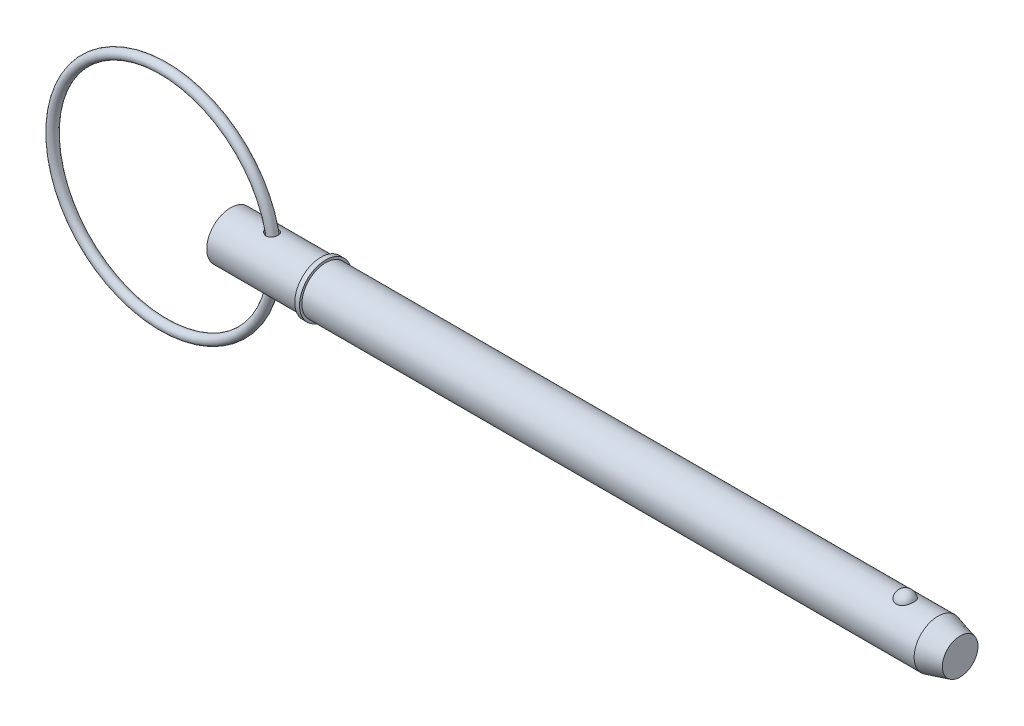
ISO-10303-21;
HEADER;
FILE_DESCRIPTION(('STEP AP214'),'2;1');
FILE_NAME('part.step','',(''),(''),'','','');
FILE_SCHEMA(('AUTOMOTIVE_DESIGN { 1 0 10303 214 1 1 1 1 }'));
ENDSEC;
DATA;
#1=APPLICATION_CONTEXT('core data for automotive mechanical design processes');
#2=APPLICATION_PROTOCOL_DEFINITION('international standard','automotive_design',2000,#1);
#3=PRODUCT_CONTEXT('',#1,'mechanical');
#4=PRODUCT('Part','Part','',(#3));
#5=PRODUCT_RELATED_PRODUCT_CATEGORY('part','',(#4));
#6=PRODUCT_DEFINITION_FORMATION('','',#4);
#7=PRODUCT_DEFINITION_CONTEXT('part definition',#1,'design');
#8=PRODUCT_DEFINITION('design','',#6,#7);
#9=PRODUCT_DEFINITION_SHAPE('','',#8);
#10=(LENGTH_UNIT() NAMED_UNIT(*) SI_UNIT(.MILLI.,.METRE.));
#11=(NAMED_UNIT(*) PLANE_ANGLE_UNIT() SI_UNIT($,.RADIAN.));
#12=(NAMED_UNIT(*) SI_UNIT($,.STERADIAN.) SOLID_ANGLE_UNIT());
#13=UNCERTAINTY_MEASURE_WITH_UNIT(LENGTH_MEASURE(1.E-05),#10,'distance_accuracy_value','');
#14=(GEOMETRIC_REPRESENTATION_CONTEXT(3) GLOBAL_UNCERTAINTY_ASSIGNED_CONTEXT((#13)) GLOBAL_UNIT_ASSIGNED_CONTEXT((#10,
#11,#12)) REPRESENTATION_CONTEXT('',''));
#15=CARTESIAN_POINT('',(0.,0.,0.));
#16=DIRECTION('',(0.,0.,1.));
#17=DIRECTION('',(1.,0.,0.));
#18=AXIS2_PLACEMENT_3D('',#15,#16,#17);
#19=CARTESIAN_POINT('',(-13.4013067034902,0.,0.));
#20=DIRECTION('',(0.,0.,1.));
#21=DIRECTION('',(1.,0.,0.));
#22=AXIS2_PLACEMENT_3D('',#19,#20,#21);
#23=TOROIDAL_SURFACE('',#22,22.225,0.952999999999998);
#24=CARTESIAN_POINT('',(9.77669329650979,0.,0.));
#25=VERTEX_POINT('',#24);
#26=VERTEX_LOOP('',#25);
#27=FACE_BOUND('',#26,.T.);
#28=ADVANCED_FACE('P0_F12',(#27),#23,.T.);
#29=CLOSED_SHELL('',(#28));
#30=MANIFOLD_SOLID_BREP('P0_B1',#29);
#31=CARTESIAN_POINT('',(0.,0.,0.));
#32=DIRECTION('',(1.,0.,0.));
#33=DIRECTION('',(0.,0.,-1.));
#34=AXIS2_PLACEMENT_3D('',#31,#32,#33);
#35=CYLINDRICAL_SURFACE('',#34,4.765);
#36=CARTESIAN_POINT('',(7.48459594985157,4.685973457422,-0.864220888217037));
#37=CARTESIAN_POINT('',(7.53849733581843,4.67711144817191,-0.912273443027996));
#38=CARTESIAN_POINT('',(7.59654891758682,4.66833039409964,-0.955745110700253));
#39=CARTESIAN_POINT('',(7.71924602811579,4.65195567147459,-1.03251233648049));
#40=CARTESIAN_POINT('',(7.78389917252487,4.64436340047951,-1.06579596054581));
#41=CARTESIAN_POINT('',(7.91808098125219,4.63129108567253,-1.12124172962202));
#42=CARTESIAN_POINT('',(7.98761280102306,4.62581242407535,-1.14339659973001));
#43=CARTESIAN_POINT('',(8.12956198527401,4.61771699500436,-1.17566870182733));
#44=CARTESIAN_POINT('',(8.20197774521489,4.61509865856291,-1.18579253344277));
#45=CARTESIAN_POINT('',(8.34550810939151,4.6131791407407,-1.19323853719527));
#46=CARTESIAN_POINT('',(8.41660306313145,4.61378793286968,-1.19090812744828));
#47=CARTESIAN_POINT('',(8.55721866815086,4.61812874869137,-1.17396277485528));
#48=CARTESIAN_POINT('',(8.62673979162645,4.62185982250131,-1.15935156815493));
#49=CARTESIAN_POINT('',(8.75801373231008,4.63172632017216,-1.11925454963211));
#50=CARTESIAN_POINT('',(8.81998342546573,4.63771186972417,-1.09443918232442));
#51=CARTESIAN_POINT('',(8.93863698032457,4.65140179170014,-1.03470792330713));
#52=CARTESIAN_POINT('',(8.99532131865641,4.65910600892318,-0.999792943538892));
#53=CARTESIAN_POINT('',(9.10080884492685,4.67519705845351,-0.921583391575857));
#54=CARTESIAN_POINT('',(9.14973848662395,4.68356861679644,-0.878455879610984));
#55=CARTESIAN_POINT('',(9.23971126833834,4.70019813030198,-0.784620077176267));
#56=CARTESIAN_POINT('',(9.28075401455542,4.7084560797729,-0.733911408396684));
#57=CARTESIAN_POINT('',(9.35441071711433,4.7240688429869,-0.62563775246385));
#58=CARTESIAN_POINT('',(9.38691359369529,4.73141115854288,-0.567995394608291));
#59=CARTESIAN_POINT('',(9.44203216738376,4.74427907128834,-0.447974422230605));
#60=CARTESIAN_POINT('',(9.46464743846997,4.74980459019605,-0.385595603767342));
#61=CARTESIAN_POINT('',(9.49961110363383,4.75848927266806,-0.257248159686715));
#62=CARTESIAN_POINT('',(9.51186382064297,4.76162635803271,-0.191251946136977));
#63=CARTESIAN_POINT('',(9.52545294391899,4.76511165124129,-0.0580729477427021));
#64=CARTESIAN_POINT('',(9.52678936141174,4.76545986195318,0.00910983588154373));
#65=CARTESIAN_POINT('',(9.51851557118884,4.76333054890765,0.142723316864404));
#66=CARTESIAN_POINT('',(9.50891008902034,4.76085424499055,0.209154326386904));
#67=CARTESIAN_POINT('',(9.47899306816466,4.75334441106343,0.339411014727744));
#68=CARTESIAN_POINT('',(9.45868126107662,4.74831081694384,0.403236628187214));
#69=CARTESIAN_POINT('',(9.4078294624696,4.73622777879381,0.526509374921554));
#70=CARTESIAN_POINT('',(9.37728413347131,4.72917728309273,0.585954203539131));
#71=CARTESIAN_POINT('',(9.30671117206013,4.71383320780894,0.698745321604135));
#72=CARTESIAN_POINT('',(9.26668347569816,4.70553961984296,0.752091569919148));
#73=CARTESIAN_POINT('',(9.17821531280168,4.68864637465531,0.851083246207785));
#74=CARTESIAN_POINT('',(9.12978756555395,4.68004719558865,0.896740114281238));
#75=CARTESIAN_POINT('',(9.02575872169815,4.66350833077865,0.97912505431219));
#76=CARTESIAN_POINT('',(8.97015856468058,4.65556855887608,1.01585429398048));
#77=CARTESIAN_POINT('',(8.85409306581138,4.6413534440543,1.0789347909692));
#78=CARTESIAN_POINT('',(8.79369898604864,4.63505812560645,1.10541268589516));
#79=CARTESIAN_POINT('',(8.66918290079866,4.62469916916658,1.1479836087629));
#80=CARTESIAN_POINT('',(8.60506121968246,4.62063533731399,1.1640775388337));
#81=CARTESIAN_POINT('',(8.47537782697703,4.61517348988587,1.18554696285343));
#82=CARTESIAN_POINT('',(8.4098281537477,4.61375835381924,1.19099130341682));
#83=CARTESIAN_POINT('',(8.2786938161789,4.61362908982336,1.19149080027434));
#84=CARTESIAN_POINT('',(8.21310914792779,4.61491539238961,1.18654430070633));
#85=CARTESIAN_POINT('',(8.08152457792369,4.62006017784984,1.16635311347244));
#86=CARTESIAN_POINT('',(8.01557748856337,4.62399895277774,1.15078675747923));
#87=CARTESIAN_POINT('',(7.88704537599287,4.63403793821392,1.10966738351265));
#88=CARTESIAN_POINT('',(7.82446148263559,4.64013886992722,1.08411103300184));
#89=CARTESIAN_POINT('',(7.70057947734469,4.65423592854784,1.02195168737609));
#90=CARTESIAN_POINT('',(7.63957197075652,4.66232221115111,0.984788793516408));
#91=CARTESIAN_POINT('',(7.52457021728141,4.67924552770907,0.900950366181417));
#92=CARTESIAN_POINT('',(7.47057819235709,4.68808279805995,0.854271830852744));
#93=CARTESIAN_POINT('',(7.37028930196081,4.70567913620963,0.751386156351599));
#94=CARTESIAN_POINT('',(7.32416327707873,4.7144333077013,0.695010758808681));
#95=CARTESIAN_POINT('',(7.24276674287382,4.73060166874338,0.574719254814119));
#96=CARTESIAN_POINT('',(7.20749051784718,4.73801656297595,0.510807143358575));
#97=CARTESIAN_POINT('',(7.15148495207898,4.75009927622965,0.381705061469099));
#98=CARTESIAN_POINT('',(7.12994463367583,4.7549169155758,0.31688231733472));
#99=CARTESIAN_POINT('',(7.09904467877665,4.76189692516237,0.184270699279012));
#100=CARTESIAN_POINT('',(7.08967554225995,4.76406136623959,0.116484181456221));
#101=CARTESIAN_POINT('',(7.08394150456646,4.76538257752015,-0.0133529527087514));
#102=CARTESIAN_POINT('',(7.0864533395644,4.76479916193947,-0.0753538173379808));
#103=CARTESIAN_POINT('',(7.10181380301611,4.76127985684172,-0.197993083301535));
#104=CARTESIAN_POINT('',(7.11466291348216,4.75834385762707,-0.258631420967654));
#105=CARTESIAN_POINT('',(7.14973937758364,4.75051877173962,-0.375744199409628));
#106=CARTESIAN_POINT('',(7.17178938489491,4.7456667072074,-0.432274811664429));
#107=CARTESIAN_POINT('',(7.22432962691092,4.73449674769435,-0.54107038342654));
#108=CARTESIAN_POINT('',(7.25481702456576,4.72817934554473,-0.593336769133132));
#109=CARTESIAN_POINT('',(7.31700895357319,4.71588241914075,-0.683642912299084));
#110=CARTESIAN_POINT('',(7.34750058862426,4.7100477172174,-0.722547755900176));
#111=CARTESIAN_POINT('',(7.41288050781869,4.69812059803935,-0.796421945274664));
#112=CARTESIAN_POINT('',(7.44776960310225,4.69202813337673,-0.831390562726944));
#113=CARTESIAN_POINT('',(7.48459594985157,4.685973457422,-0.864220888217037));
#114=B_SPLINE_CURVE_WITH_KNOTS('',3,(#36,#37,#38,#39,#40,#41,#42,#43,#44,#45,#46,#47,#48,#49,
#50,#51,#52,#53,#54,#55,#56,#57,#58,#59,#60,#61,#62,#63,#64,#65,#66,#67,#68,#69,#70,#71,#72,#73,
#74,#75,#76,#77,#78,#79,#80,#81,#82,#83,#84,#85,#86,#87,#88,#89,#90,#91,#92,#93,#94,#95,#96,#97,
#98,#99,#100,#101,#102,#103,#104,#105,#106,#107,#108,#109,#110,#111,#112,#113),.UNSPECIFIED.,
.T.,.F.,(4,2,2,2,2,2,2,2,2,2,2,2,2,2,2,2,2,2,2,2,2,2,2,2,2,2,2,2,2,2,2,2,2,2,2,2,2,2,4),(0.,
0.218078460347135,0.436411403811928,0.654886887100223,0.873242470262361,1.08553925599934,
1.2977714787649,1.49785367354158,1.6979178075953,1.8942789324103,2.09064985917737,
2.28946102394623,2.48828075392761,2.68891673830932,2.88955251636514,3.09010167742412,
3.29065586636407,3.49131482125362,3.69197512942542,3.89233421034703,4.09266707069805,
4.29043955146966,4.48819484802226,4.68466743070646,4.8811713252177,5.08390806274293,
5.28671248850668,5.50140943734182,5.71617422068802,5.93513249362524,6.15397522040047,
6.35827356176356,6.56241234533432,6.74765856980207,6.93291343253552,7.11475139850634,
7.29652829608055,7.44549570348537,7.59449062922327),.UNSPECIFIED.);
#115=CARTESIAN_POINT('',(7.48459594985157,4.685973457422,-0.864220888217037));
#116=VERTEX_POINT('',#115);
#117=EDGE_CURVE('P1_E42',#116,#116,#114,.T.);
#118=ORIENTED_EDGE('',*,*,#117,.T.);
#119=EDGE_LOOP('',(#118));
#120=FACE_BOUND('',#119,.T.);
#121=CARTESIAN_POINT('',(0.,0.,0.));
#122=DIRECTION('',(1.,0.,0.));
#123=DIRECTION('',(0.,0.,-1.));
#124=AXIS2_PLACEMENT_3D('',#121,#122,#123);
#125=CIRCLE('',#124,4.765);
#126=CARTESIAN_POINT('',(0.,0.,-4.765));
#127=VERTEX_POINT('',#126);
#128=EDGE_CURVE('P1_E9',#127,#127,#125,.T.);
#129=ORIENTED_EDGE('',*,*,#128,.T.);
#130=EDGE_LOOP('',(#129));
#131=FACE_BOUND('',#130,.T.);
#132=CARTESIAN_POINT('',(18.097,0.,0.));
#133=DIRECTION('',(1.,0.,0.));
#134=DIRECTION('',(0.,0.,-1.));
#135=AXIS2_PLACEMENT_3D('',#132,#133,#134);
#136=CIRCLE('',#135,4.765);
#137=CARTESIAN_POINT('',(18.097,0.,-4.765));
#138=VERTEX_POINT('',#137);
#139=EDGE_CURVE('P1_E25',#138,#138,#136,.T.);
#140=ORIENTED_EDGE('',*,*,#139,.F.);
#141=EDGE_LOOP('',(#140));
#142=FACE_BOUND('',#141,.T.);
#143=CARTESIAN_POINT('',(7.48459594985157,-4.685973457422,-0.864220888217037));
#144=CARTESIAN_POINT('',(7.43440944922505,-4.6942250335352,-0.819477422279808));
#145=CARTESIAN_POINT('',(7.38778663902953,-4.70255210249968,-0.77073361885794));
#146=CARTESIAN_POINT('',(7.3030968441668,-4.7184989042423,-0.666172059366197));
#147=CARTESIAN_POINT('',(7.26503010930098,-4.72611861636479,-0.610354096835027));
#148=CARTESIAN_POINT('',(7.19878266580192,-4.73983819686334,-0.492624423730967));
#149=CARTESIAN_POINT('',(7.17064194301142,-4.74593188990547,-0.430689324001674));
#150=CARTESIAN_POINT('',(7.12584349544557,-4.75581281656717,-0.3026233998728));
#151=CARTESIAN_POINT('',(7.10917889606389,-4.75960143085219,-0.236495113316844));
#152=CARTESIAN_POINT('',(7.0889853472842,-4.76421379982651,-0.106818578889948));
#153=CARTESIAN_POINT('',(7.0846333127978,-4.76522320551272,-0.0434047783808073));
#154=CARTESIAN_POINT('',(7.08693064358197,-4.7646936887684,0.0832041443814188));
#155=CARTESIAN_POINT('',(7.09357756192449,-4.76315533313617,0.146399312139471));
#156=CARTESIAN_POINT('',(7.11694629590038,-4.75784365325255,0.267709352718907));
#157=CARTESIAN_POINT('',(7.13318365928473,-4.75417793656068,0.325923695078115));
#158=CARTESIAN_POINT('',(7.17459606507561,-4.74508048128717,0.438922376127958));
#159=CARTESIAN_POINT('',(7.19977257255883,-4.73964845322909,0.493706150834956));
#160=CARTESIAN_POINT('',(7.25946789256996,-4.72725615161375,0.60111049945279));
#161=CARTESIAN_POINT('',(7.2943661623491,-4.72023663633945,0.653512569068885));
#162=CARTESIAN_POINT('',(7.37173226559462,-4.70550732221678,0.752279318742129));
#163=CARTESIAN_POINT('',(7.41420315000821,-4.69779724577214,0.798641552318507));
#164=CARTESIAN_POINT('',(7.50982312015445,-4.6816641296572,0.888551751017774));
#165=CARTESIAN_POINT('',(7.56359853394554,-4.67324162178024,0.931434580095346));
#166=CARTESIAN_POINT('',(7.67736628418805,-4.65728554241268,1.00819498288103));
#167=CARTESIAN_POINT('',(7.7373611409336,-4.64975233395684,1.04206888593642));
#168=CARTESIAN_POINT('',(7.86574076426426,-4.63599923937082,1.10169445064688));
#169=CARTESIAN_POINT('',(7.93441048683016,-4.62988111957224,1.12685968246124));
#170=CARTESIAN_POINT('',(8.07519000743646,-4.62035710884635,1.16529928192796));
#171=CARTESIAN_POINT('',(8.14729925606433,-4.61695078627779,1.1785755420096));
#172=CARTESIAN_POINT('',(8.29111621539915,-4.61341807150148,1.19232949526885));
#173=CARTESIAN_POINT('',(8.36279361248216,-4.61321655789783,1.19310032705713));
#174=CARTESIAN_POINT('',(8.50512944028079,-4.61602317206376,1.1821962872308));
#175=CARTESIAN_POINT('',(8.57578827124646,-4.61903000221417,1.17052644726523));
#176=CARTESIAN_POINT('',(8.70965757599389,-4.62766311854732,1.13589249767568));
#177=CARTESIAN_POINT('',(8.77306169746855,-4.63312492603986,1.11363308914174));
#178=CARTESIAN_POINT('',(8.8949702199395,-4.64598463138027,1.05869880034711));
#179=CARTESIAN_POINT('',(8.95347516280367,-4.65338231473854,1.02602507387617));
#180=CARTESIAN_POINT('',(9.06253415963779,-4.66906009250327,0.952097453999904));
#181=CARTESIAN_POINT('',(9.11324728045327,-4.67731427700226,0.911072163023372));
#182=CARTESIAN_POINT('',(9.20707850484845,-4.69393979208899,0.821122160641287));
#183=CARTESIAN_POINT('',(9.25019629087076,-4.70231112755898,0.772197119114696));
#184=CARTESIAN_POINT('',(9.32819072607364,-4.71835356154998,0.667239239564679));
#185=CARTESIAN_POINT('',(9.36297449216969,-4.72601623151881,0.611136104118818));
#186=CARTESIAN_POINT('',(9.42286382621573,-4.73971239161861,0.493799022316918));
#187=CARTESIAN_POINT('',(9.44796891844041,-4.74574580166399,0.432564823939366));
#188=CARTESIAN_POINT('',(9.48811605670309,-4.75559286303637,0.305990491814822));
#189=CARTESIAN_POINT('',(9.50304870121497,-4.75938232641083,0.240613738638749));
#190=CARTESIAN_POINT('',(9.5220569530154,-4.76423188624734,0.108201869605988));
#191=CARTESIAN_POINT('',(9.52613255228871,-4.76529198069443,0.0411667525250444));
#192=CARTESIAN_POINT('',(9.52332772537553,-4.76456884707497,-0.0926701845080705));
#193=CARTESIAN_POINT('',(9.51644541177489,-4.76278512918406,-0.159471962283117));
#194=CARTESIAN_POINT('',(9.49188827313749,-4.75656536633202,-0.290934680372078));
#195=CARTESIAN_POINT('',(9.47421322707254,-4.75212926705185,-0.355595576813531));
#196=CARTESIAN_POINT('',(9.42849503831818,-4.74108318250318,-0.480955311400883));
#197=CARTESIAN_POINT('',(9.4004503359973,-4.73447287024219,-0.541653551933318));
#198=CARTESIAN_POINT('',(9.33467290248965,-4.71979928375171,-0.657361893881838));
#199=CARTESIAN_POINT('',(9.29694000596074,-4.71173598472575,-0.712371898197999));
#200=CARTESIAN_POINT('',(9.2127449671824,-4.69505469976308,-0.815106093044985));
#201=CARTESIAN_POINT('',(9.1662875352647,-4.68643701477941,-0.862834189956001));
#202=CARTESIAN_POINT('',(9.06584125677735,-4.66961864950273,-0.949656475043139));
#203=CARTESIAN_POINT('',(9.01185326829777,-4.66141792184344,-0.98875164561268));
#204=CARTESIAN_POINT('',(8.8985010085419,-4.64646376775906,-1.0567894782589));
#205=CARTESIAN_POINT('',(8.83920621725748,-4.63969468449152,-1.08584444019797));
#206=CARTESIAN_POINT('',(8.71642097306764,-4.62824519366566,-1.13365785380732));
#207=CARTESIAN_POINT('',(8.65293102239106,-4.623564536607,-1.15241753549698));
#208=CARTESIAN_POINT('',(8.52421291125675,-4.61681938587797,-1.17914952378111));
#209=CARTESIAN_POINT('',(8.45900634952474,-4.6147310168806,-1.18722032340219));
#210=CARTESIAN_POINT('',(8.32811210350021,-4.61325848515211,-1.19292878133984));
#211=CARTESIAN_POINT('',(8.26242433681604,-4.61387479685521,-1.19056460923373));
#212=CARTESIAN_POINT('',(8.13057358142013,-4.6177227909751,-1.17555160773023));
#213=CARTESIAN_POINT('',(8.06444352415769,-4.62102282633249,-1.16263394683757));
#214=CARTESIAN_POINT('',(7.93513143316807,-4.62989870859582,-1.12676570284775));
#215=CARTESIAN_POINT('',(7.87194976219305,-4.6354748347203,-1.10381388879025));
#216=CARTESIAN_POINT('',(7.75155849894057,-4.64811746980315,-1.04928030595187));
#217=CARTESIAN_POINT('',(7.69423767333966,-4.65514232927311,-1.01793362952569));
#218=CARTESIAN_POINT('',(7.58503138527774,-4.67007903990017,-0.947046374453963));
#219=CARTESIAN_POINT('',(7.53314612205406,-4.67799092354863,-0.907505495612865));
#220=CARTESIAN_POINT('',(7.48459594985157,-4.685973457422,-0.864220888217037));
#221=B_SPLINE_CURVE_WITH_KNOTS('',3,(#143,#144,#145,#146,#147,#148,#149,#150,#151,#152,#153,
#154,#155,#156,#157,#158,#159,#160,#161,#162,#163,#164,#165,#166,#167,#168,#169,#170,#171,#172,
#173,#174,#175,#176,#177,#178,#179,#180,#181,#182,#183,#184,#185,#186,#187,#188,#189,#190,#191,
#192,#193,#194,#195,#196,#197,#198,#199,#200,#201,#202,#203,#204,#205,#206,#207,#208,#209,#210,
#211,#212,#213,#214,#215,#216,#217,#218,#219,#220),.UNSPECIFIED.,.T.,.F.,(4,2,2,2,2,2,2,2,2,2,2,
2,2,2,2,2,2,2,2,2,2,2,2,2,2,2,2,2,2,2,2,2,2,2,2,2,2,2,4),(0.,0.203013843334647,
0.406033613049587,0.609862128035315,0.813568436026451,1.0032929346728,1.19297523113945,
1.37380897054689,1.55467236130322,1.74393241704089,1.93326889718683,2.14025373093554,
2.3473227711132,2.566425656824,2.78549366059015,2.9994188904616,3.21325763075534,
3.41451842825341,3.61575693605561,3.81208930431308,4.00842987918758,4.20686629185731,
4.40531245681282,4.60586051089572,4.80640871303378,5.0069914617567,5.20757831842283,
5.40819535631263,5.60881581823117,5.80932827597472,6.00981790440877,6.2079863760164,
6.40613116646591,6.60243714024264,6.79877754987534,7.00028133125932,7.20180983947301,
7.39819723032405,7.59459181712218),.UNSPECIFIED.);
#222=CARTESIAN_POINT('',(7.48459594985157,-4.685973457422,-0.864220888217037));
#223=VERTEX_POINT('',#222);
#224=EDGE_CURVE('P1_E17',#223,#223,#221,.T.);
#225=ORIENTED_EDGE('',*,*,#224,.T.);
#226=EDGE_LOOP('',(#225));
#227=FACE_BOUND('',#226,.T.);
#228=ADVANCED_FACE('P1_F13',(#120,#131,#142,#227),#35,.T.);
#229=CARTESIAN_POINT('',(0.,0.,0.));
#230=DIRECTION('',(1.,0.,0.));
#231=DIRECTION('',(0.,0.,-1.));
#232=AXIS2_PLACEMENT_3D('',#229,#230,#231);
#233=CYLINDRICAL_SURFACE('',#232,4.765);
#234=CARTESIAN_POINT('',(141.604194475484,0.,0.));
#235=DIRECTION('',(1.,0.,0.));
#236=DIRECTION('',(0.,0.,-1.));
#237=AXIS2_PLACEMENT_3D('',#234,#235,#236);
#238=CIRCLE('',#237,4.765);
#239=CARTESIAN_POINT('',(141.604194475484,0.,-4.765));
#240=VERTEX_POINT('',#239);
#241=EDGE_CURVE('P1_E99',#240,#240,#238,.T.);
#242=ORIENTED_EDGE('',*,*,#241,.F.);
#243=EDGE_LOOP('',(#242));
#244=FACE_BOUND('',#243,.T.);
#245=CARTESIAN_POINT('',(19.05,0.,0.));
#246=DIRECTION('',(1.,0.,0.));
#247=DIRECTION('',(0.,0.,-1.));
#248=AXIS2_PLACEMENT_3D('',#245,#246,#247);
#249=CIRCLE('',#248,4.765);
#250=CARTESIAN_POINT('',(19.05,0.,-4.765));
#251=VERTEX_POINT('',#250);
#252=EDGE_CURVE('P1_E96',#251,#251,#249,.T.);
#253=ORIENTED_EDGE('',*,*,#252,.T.);
#254=EDGE_LOOP('',(#253));
#255=FACE_BOUND('',#254,.T.);
#256=CARTESIAN_POINT('',(135.051020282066,4.42764777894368,1.76101111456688));
#257=CARTESIAN_POINT('',(134.959721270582,4.42764470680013,1.76101422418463));
#258=CARTESIAN_POINT('',(134.868446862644,4.43059091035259,1.75366340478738));
#259=CARTESIAN_POINT('',(134.688615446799,4.44201846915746,1.72451180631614));
#260=CARTESIAN_POINT('',(134.600057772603,4.45049845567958,1.70271460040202));
#261=CARTESIAN_POINT('',(134.428257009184,4.47200516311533,1.64539370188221));
#262=CARTESIAN_POINT('',(134.345006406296,4.48502527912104,1.60988994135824));
#263=CARTESIAN_POINT('',(134.185763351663,4.51419542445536,1.52617873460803));
#264=CARTESIAN_POINT('',(134.109772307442,4.53034605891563,1.47796883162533));
#265=CARTESIAN_POINT('',(133.964744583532,4.56459317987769,1.36860494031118));
#266=CARTESIAN_POINT('',(133.895964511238,4.58273170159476,1.30712420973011));
#267=CARTESIAN_POINT('',(133.769342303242,4.61870302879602,1.17370204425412));
#268=CARTESIAN_POINT('',(133.711502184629,4.63653577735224,1.10175868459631));
#269=CARTESIAN_POINT('',(133.605570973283,4.67090140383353,0.945806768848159));
#270=CARTESIAN_POINT('',(133.558030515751,4.68734068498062,0.861402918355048));
#271=CARTESIAN_POINT('',(133.477081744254,4.71628466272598,0.685442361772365));
#272=CARTESIAN_POINT('',(133.443674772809,4.72878898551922,0.593884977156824));
#273=CARTESIAN_POINT('',(133.391287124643,4.74874061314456,0.404781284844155));
#274=CARTESIAN_POINT('',(133.372517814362,4.75611366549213,0.307168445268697));
#275=CARTESIAN_POINT('',(133.350584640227,4.76475393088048,0.109940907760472));
#276=CARTESIAN_POINT('',(133.347420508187,4.76602124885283,0.0103262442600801));
#277=CARTESIAN_POINT('',(133.356740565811,4.76232928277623,-0.187629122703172));
#278=CARTESIAN_POINT('',(133.369158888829,4.7573962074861,-0.285973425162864));
#279=CARTESIAN_POINT('',(133.409280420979,4.74184975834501,-0.479027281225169));
#280=CARTESIAN_POINT('',(133.436983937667,4.7312362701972,-0.573736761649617));
#281=CARTESIAN_POINT('',(133.507158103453,4.70540026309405,-0.756973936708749));
#282=CARTESIAN_POINT('',(133.549646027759,4.69017235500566,-0.845494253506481));
#283=CARTESIAN_POINT('',(133.648520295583,4.6566986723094,-1.01378033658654));
#284=CARTESIAN_POINT('',(133.704907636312,4.63845268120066,-1.09354547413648));
#285=CARTESIAN_POINT('',(133.830552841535,4.60085438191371,-1.24228523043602));
#286=CARTESIAN_POINT('',(133.899843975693,4.58149930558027,-1.31123108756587));
#287=CARTESIAN_POINT('',(134.049606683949,4.54391653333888,-1.43607409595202));
#288=CARTESIAN_POINT('',(134.130077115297,4.52568872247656,-1.49197257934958));
#289=CARTESIAN_POINT('',(134.298150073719,4.49293007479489,-1.58786764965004));
#290=CARTESIAN_POINT('',(134.385544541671,4.47832346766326,-1.62820219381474));
#291=CARTESIAN_POINT('',(134.566553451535,4.45406011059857,-1.69345757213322));
#292=CARTESIAN_POINT('',(134.66016555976,4.44440151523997,-1.71838415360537));
#293=CARTESIAN_POINT('',(134.845893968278,4.43159888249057,-1.75112843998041));
#294=CARTESIAN_POINT('',(134.937849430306,4.42815213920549,-1.75974223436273));
#295=CARTESIAN_POINT('',(135.121965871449,4.427247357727,-1.76201865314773));
#296=CARTESIAN_POINT('',(135.214126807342,4.42978816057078,-1.7556841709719));
#297=CARTESIAN_POINT('',(135.393129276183,4.44038648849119,-1.72869560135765));
#298=CARTESIAN_POINT('',(135.480047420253,4.44827555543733,-1.70847853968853));
#299=CARTESIAN_POINT('',(135.649131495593,4.46852246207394,-1.65479562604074));
#300=CARTESIAN_POINT('',(135.731297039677,4.48088066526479,-1.62132869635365));
#301=CARTESIAN_POINT('',(135.890591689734,4.50907357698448,-1.54120560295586));
#302=CARTESIAN_POINT('',(135.967570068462,4.52497884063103,-1.49427526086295));
#303=CARTESIAN_POINT('',(136.112708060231,4.55845148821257,-1.38881222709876));
#304=CARTESIAN_POINT('',(136.180865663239,4.57601924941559,-1.3302768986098));
#305=CARTESIAN_POINT('',(136.310099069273,4.61196537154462,-1.1999104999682));
#306=CARTESIAN_POINT('',(136.370656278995,4.63034074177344,-1.12756415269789));
#307=CARTESIAN_POINT('',(136.479279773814,4.66513959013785,-0.973612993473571));
#308=CARTESIAN_POINT('',(136.527343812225,4.68156271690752,-0.89200652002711));
#309=CARTESIAN_POINT('',(136.611383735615,4.71130224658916,-0.718892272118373));
#310=CARTESIAN_POINT('',(136.646918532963,4.724501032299,-0.627149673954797));
#311=CARTESIAN_POINT('',(136.702952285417,4.74571823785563,-0.438611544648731));
#312=CARTESIAN_POINT('',(136.723450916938,4.75373654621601,-0.341815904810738));
#313=CARTESIAN_POINT('',(136.749033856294,4.76378905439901,-0.145633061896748));
#314=CARTESIAN_POINT('',(136.754076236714,4.76580697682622,-0.0462395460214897));
#315=CARTESIAN_POINT('',(136.748523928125,4.7636057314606,0.152038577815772));
#316=CARTESIAN_POINT('',(136.737929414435,4.75938663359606,0.250923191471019));
#317=CARTESIAN_POINT('',(136.701387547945,4.74516937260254,0.445004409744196));
#318=CARTESIAN_POINT('',(136.675496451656,4.73519238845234,0.540213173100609));
#319=CARTESIAN_POINT('',(136.608927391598,4.71049394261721,0.724662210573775));
#320=CARTESIAN_POINT('',(136.568248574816,4.69577220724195,0.813902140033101));
#321=CARTESIAN_POINT('',(136.472717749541,4.66303767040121,0.98431305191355));
#322=CARTESIAN_POINT('',(136.417804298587,4.64501070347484,1.06544688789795));
#323=CARTESIAN_POINT('',(136.295049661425,4.60764678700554,1.21692673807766));
#324=CARTESIAN_POINT('',(136.227208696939,4.58830985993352,1.28727293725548));
#325=CARTESIAN_POINT('',(136.080548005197,4.55060370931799,1.41479271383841));
#326=CARTESIAN_POINT('',(136.001791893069,4.53222967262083,1.47203785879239));
#327=CARTESIAN_POINT('',(135.834989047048,4.49849576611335,1.57212016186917));
#328=CARTESIAN_POINT('',(135.746941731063,4.48313608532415,1.6149564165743));
#329=CARTESIAN_POINT('',(135.559791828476,4.45676184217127,1.68642657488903));
#330=CARTESIAN_POINT('',(135.460365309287,4.44598302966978,1.71430590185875));
#331=CARTESIAN_POINT('',(135.257621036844,4.43142918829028,1.75159258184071));
#332=CARTESIAN_POINT('',(135.154304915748,4.42765125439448,1.76100759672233));
#333=CARTESIAN_POINT('',(135.051020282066,4.42764777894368,1.76101111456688));
#334=B_SPLINE_CURVE_WITH_KNOTS('',3,(#256,#257,#258,#259,#260,#261,#262,#263,#264,#265,#266,
#267,#268,#269,#270,#271,#272,#273,#274,#275,#276,#277,#278,#279,#280,#281,#282,#283,#284,#285,
#286,#287,#288,#289,#290,#291,#292,#293,#294,#295,#296,#297,#298,#299,#300,#301,#302,#303,#304,
#305,#306,#307,#308,#309,#310,#311,#312,#313,#314,#315,#316,#317,#318,#319,#320,#321,#322,#323,
#324,#325,#326,#327,#328,#329,#330,#331,#332,#333),.UNSPECIFIED.,.T.,.F.,(4,2,2,2,2,2,2,2,2,2,2,
2,2,2,2,2,2,2,2,2,2,2,2,2,2,2,2,2,2,2,2,2,2,2,2,2,2,2,4),(0.,0.273517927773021,
0.546968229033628,0.820022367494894,1.09312934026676,1.37393946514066,1.6548013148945,
1.94820420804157,2.24163496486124,2.53922817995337,2.83681628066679,3.13315071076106,
3.42949110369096,3.72617893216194,4.02288805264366,4.32037303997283,4.61782764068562,
4.90840095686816,5.19886582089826,5.47474855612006,5.75057789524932,6.0180997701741,
6.28564340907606,6.55907787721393,6.83257454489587,7.11962987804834,7.4067367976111,
7.70312663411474,7.99952284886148,8.29672237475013,8.59391856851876,8.89002850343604,
9.18615552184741,9.48358266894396,9.78100471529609,10.0767610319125,10.3725358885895,
10.6820893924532,10.991514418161),.UNSPECIFIED.);
#335=CARTESIAN_POINT('',(135.051020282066,4.42764777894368,1.76101111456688));
#336=VERTEX_POINT('',#335);
#337=EDGE_CURVE('P1_E34',#336,#336,#334,.T.);
#338=ORIENTED_EDGE('',*,*,#337,.T.);
#339=EDGE_LOOP('',(#338));
#340=FACE_BOUND('',#339,.T.);
#341=ADVANCED_FACE('P1_F46',(#244,#255,#340),#233,.T.);
#342=CARTESIAN_POINT('',(0.,0.,0.));
#343=DIRECTION('',(-1.,0.,0.));
#344=DIRECTION('',(0.,0.,1.));
#345=AXIS2_PLACEMENT_3D('',#342,#343,#344);
#346=PLANE('',#345);
#347=ORIENTED_EDGE('',*,*,#128,.F.);
#348=EDGE_LOOP('',(#347));
#349=FACE_BOUND('',#348,.T.);
#350=ADVANCED_FACE('P1_F15',(#349),#346,.T.);
#351=CARTESIAN_POINT('',(18.097,4.765,0.));
#352=DIRECTION('',(-1.,0.,0.));
#353=DIRECTION('',(0.,0.,1.));
#354=AXIS2_PLACEMENT_3D('',#351,#352,#353);
#355=PLANE('',#354);
#356=ORIENTED_EDGE('',*,*,#139,.T.);
#357=EDGE_LOOP('',(#356));
#358=FACE_BOUND('',#357,.T.);
#359=CARTESIAN_POINT('',(18.097,0.,0.));
#360=DIRECTION('',(1.,0.,0.));
#361=DIRECTION('',(0.,0.,-1.));
#362=AXIS2_PLACEMENT_3D('',#359,#360,#361);
#363=CIRCLE('',#362,5.2415);
#364=CARTESIAN_POINT('',(18.097,0.,-5.2415));
#365=VERTEX_POINT('',#364);
#366=EDGE_CURVE('P1_E30',#365,#365,#363,.T.);
#367=ORIENTED_EDGE('',*,*,#366,.F.);
#368=EDGE_LOOP('',(#367));
#369=FACE_BOUND('',#368,.T.);
#370=ADVANCED_FACE('P1_F81',(#358,#369),#355,.T.);
#371=CARTESIAN_POINT('',(0.,0.,0.));
#372=DIRECTION('',(1.,0.,0.));
#373=DIRECTION('',(0.,0.,-1.));
#374=AXIS2_PLACEMENT_3D('',#371,#372,#373);
#375=CYLINDRICAL_SURFACE('',#374,5.2415);
#376=ORIENTED_EDGE('',*,*,#366,.T.);
#377=EDGE_LOOP('',(#376));
#378=FACE_BOUND('',#377,.T.);
#379=CARTESIAN_POINT('',(19.05,0.,0.));
#380=DIRECTION('',(1.,0.,0.));
#381=DIRECTION('',(0.,0.,-1.));
#382=AXIS2_PLACEMENT_3D('',#379,#380,#381);
#383=CIRCLE('',#382,5.2415);
#384=CARTESIAN_POINT('',(19.05,0.,-5.2415));
#385=VERTEX_POINT('',#384);
#386=EDGE_CURVE('P1_E95',#385,#385,#383,.T.);
#387=ORIENTED_EDGE('',*,*,#386,.F.);
#388=EDGE_LOOP('',(#387));
#389=FACE_BOUND('',#388,.T.);
#390=ADVANCED_FACE('P1_F68',(#378,#389),#375,.T.);
#391=CARTESIAN_POINT('',(19.05,5.2415,0.));
#392=DIRECTION('',(1.,0.,0.));
#393=DIRECTION('',(0.,0.,-1.));
#394=AXIS2_PLACEMENT_3D('',#391,#392,#393);
#395=PLANE('',#394);
#396=ORIENTED_EDGE('',*,*,#386,.T.);
#397=EDGE_LOOP('',(#396));
#398=FACE_BOUND('',#397,.T.);
#399=ORIENTED_EDGE('',*,*,#252,.F.);
#400=EDGE_LOOP('',(#399));
#401=FACE_BOUND('',#400,.T.);
#402=ADVANCED_FACE('P1_F62',(#398,#401),#395,.T.);
#403=CARTESIAN_POINT('',(146.05,0.,0.));
#404=DIRECTION('',(-1.,0.,0.));
#405=DIRECTION('',(0.,0.,1.));
#406=AXIS2_PLACEMENT_3D('',#403,#404,#405);
#407=CONICAL_SURFACE('',#406,3.57375000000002,0.26179938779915);
#408=ORIENTED_EDGE('',*,*,#241,.T.);
#409=EDGE_LOOP('',(#408));
#410=FACE_BOUND('',#409,.T.);
#411=CARTESIAN_POINT('',(146.05,0.,0.));
#412=DIRECTION('',(1.,0.,0.));
#413=DIRECTION('',(0.,0.,-1.));
#414=AXIS2_PLACEMENT_3D('',#411,#412,#413);
#415=CIRCLE('',#414,3.57375000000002);
#416=CARTESIAN_POINT('',(146.05,0.,-3.57375000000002));
#417=VERTEX_POINT('',#416);
#418=EDGE_CURVE('P1_E41',#417,#417,#415,.T.);
#419=ORIENTED_EDGE('',*,*,#418,.F.);
#420=EDGE_LOOP('',(#419));
#421=FACE_BOUND('',#420,.T.);
#422=ADVANCED_FACE('P1_F59',(#410,#421),#407,.T.);
#423=CARTESIAN_POINT('',(146.05,3.57375000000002,0.));
#424=DIRECTION('',(1.,0.,0.));
#425=DIRECTION('',(0.,0.,-1.));
#426=AXIS2_PLACEMENT_3D('',#423,#424,#425);
#427=PLANE('',#426);
#428=ORIENTED_EDGE('',*,*,#418,.T.);
#429=EDGE_LOOP('',(#428));
#430=FACE_BOUND('',#429,.T.);
#431=ADVANCED_FACE('P1_F55',(#430),#427,.T.);
#432=CARTESIAN_POINT('',(135.051020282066,4.28849999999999,0.));
#433=DIRECTION('',(-1.,0.,0.));
#434=DIRECTION('',(0.,1.,0.));
#435=AXIS2_PLACEMENT_3D('',#432,#433,#434);
#436=SPHERICAL_SURFACE('',#435,1.7665);
#437=ORIENTED_EDGE('',*,*,#337,.F.);
#438=EDGE_LOOP('',(#437));
#439=FACE_BOUND('',#438,.T.);
#440=ADVANCED_FACE('P1_F50',(#439),#436,.T.);
#441=CARTESIAN_POINT('',(-13.4013067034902,0.,0.));
#442=DIRECTION('',(0.,0.,1.));
#443=DIRECTION('',(1.,0.,0.));
#444=AXIS2_PLACEMENT_3D('',#441,#442,#443);
#445=TOROIDAL_SURFACE('',#444,22.225,1.19125);
#446=ORIENTED_EDGE('',*,*,#224,.F.);
#447=EDGE_LOOP('',(#446));
#448=FACE_BOUND('',#447,.T.);
#449=ORIENTED_EDGE('',*,*,#117,.F.);
#450=EDGE_LOOP('',(#449));
#451=FACE_BOUND('',#450,.T.);
#452=ADVANCED_FACE('P1_F54',(#448,#451),#445,.F.);
#453=CLOSED_SHELL('',(#228,#341,#350,#370,#390,#402,#422,#431,#440,#452));
#454=MANIFOLD_SOLID_BREP('P1_B1',#453);
#455=ADVANCED_BREP_SHAPE_REPRESENTATION('',(#18,#30,#454),#14);
#456=SHAPE_DEFINITION_REPRESENTATION(#9,#455);
ENDSEC;
END-ISO-10303-21;
